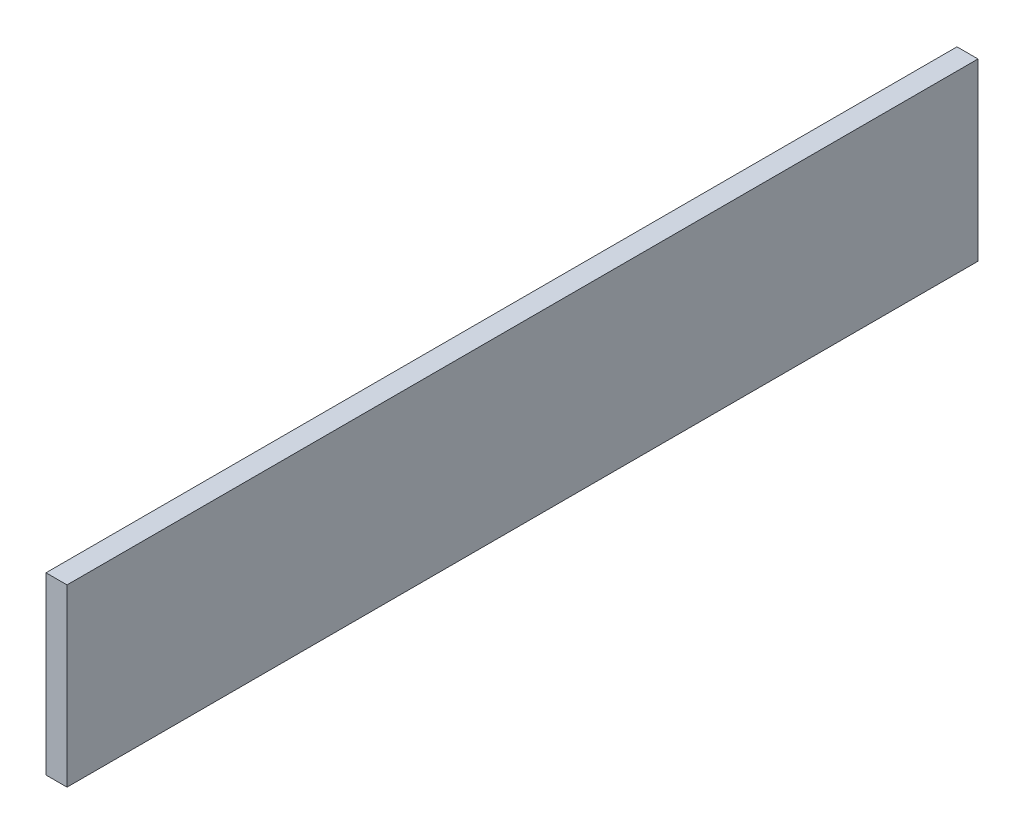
from build123d import *

# Parameters (mm, degrees)
BOSS_EXTRU_1_DEPTH      = 10
BOSS_EXTRU_1_DEPTH_BACK = 120
ESQUISSE1_W             = 3
ESQUISSE1_H             = 25


with BuildPart() as part:
    # Esquisse1 → Boss.-Extru.1 (new, two sides: drawn at the far end of the back side and taken through both)
    with BuildSketch(Plane.XY.offset(-BOSS_EXTRU_1_DEPTH_BACK)):
        with Locations((0, 107.5)):
            Rectangle(ESQUISSE1_W, ESQUISSE1_H)
    extrude(amount=BOSS_EXTRU_1_DEPTH + BOSS_EXTRU_1_DEPTH_BACK)


solid = part.part
